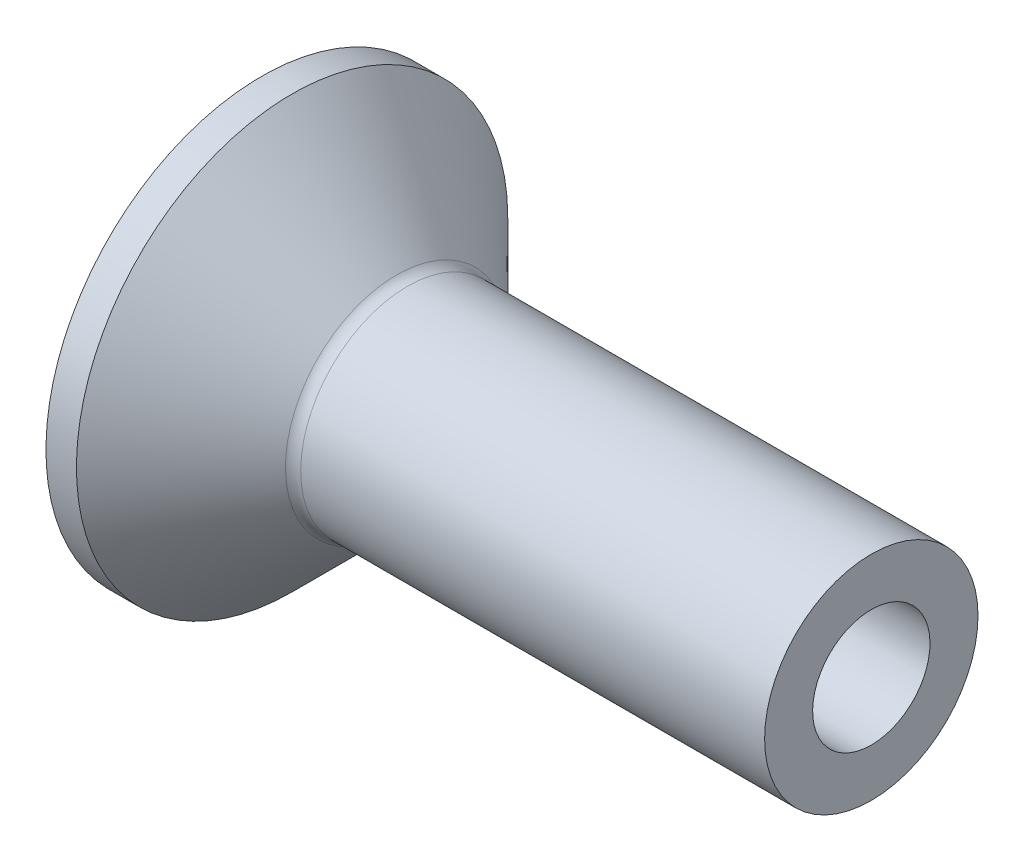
ISO-10303-21;
HEADER;
FILE_DESCRIPTION(('STEP AP214'),'2;1');
FILE_NAME('part.step','',(''),(''),'','','');
FILE_SCHEMA(('AUTOMOTIVE_DESIGN { 1 0 10303 214 1 1 1 1 }'));
ENDSEC;
DATA;
#1=APPLICATION_CONTEXT('core data for automotive mechanical design processes');
#2=APPLICATION_PROTOCOL_DEFINITION('international standard','automotive_design',2000,#1);
#3=PRODUCT_CONTEXT('',#1,'mechanical');
#4=PRODUCT('Part','Part','',(#3));
#5=PRODUCT_RELATED_PRODUCT_CATEGORY('part','',(#4));
#6=PRODUCT_DEFINITION_FORMATION('','',#4);
#7=PRODUCT_DEFINITION_CONTEXT('part definition',#1,'design');
#8=PRODUCT_DEFINITION('design','',#6,#7);
#9=PRODUCT_DEFINITION_SHAPE('','',#8);
#10=(LENGTH_UNIT() NAMED_UNIT(*) SI_UNIT(.MILLI.,.METRE.));
#11=(NAMED_UNIT(*) PLANE_ANGLE_UNIT() SI_UNIT($,.RADIAN.));
#12=(NAMED_UNIT(*) SI_UNIT($,.STERADIAN.) SOLID_ANGLE_UNIT());
#13=UNCERTAINTY_MEASURE_WITH_UNIT(LENGTH_MEASURE(1.E-05),#10,'distance_accuracy_value','');
#14=(GEOMETRIC_REPRESENTATION_CONTEXT(3) GLOBAL_UNCERTAINTY_ASSIGNED_CONTEXT((#13)) GLOBAL_UNIT_ASSIGNED_CONTEXT((#10,
#11,#12)) REPRESENTATION_CONTEXT('',''));
#15=CARTESIAN_POINT('',(0.,0.,0.));
#16=DIRECTION('',(0.,0.,1.));
#17=DIRECTION('',(1.,0.,0.));
#18=AXIS2_PLACEMENT_3D('',#15,#16,#17);
#19=CARTESIAN_POINT('',(4.,0.700000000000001,0.));
#20=DIRECTION('',(-1.,0.,0.));
#21=DIRECTION('',(0.,-1.,0.));
#22=AXIS2_PLACEMENT_3D('',#19,#20,#21);
#23=PLANE('',#22);
#24=CARTESIAN_POINT('',(4.,0.,0.));
#25=DIRECTION('',(-1.,0.,0.));
#26=DIRECTION('',(0.,-1.,0.));
#27=AXIS2_PLACEMENT_3D('',#24,#25,#26);
#28=CIRCLE('',#27,0.7);
#29=CARTESIAN_POINT('',(4.,-0.7,0.));
#30=VERTEX_POINT('',#29);
#31=EDGE_CURVE('E51',#30,#30,#28,.T.);
#32=ORIENTED_EDGE('',*,*,#31,.F.);
#33=EDGE_LOOP('',(#32));
#34=FACE_BOUND('',#33,.T.);
#35=CARTESIAN_POINT('',(4.,0.,0.));
#36=DIRECTION('',(-1.,0.,0.));
#37=DIRECTION('',(0.,-1.,0.));
#38=AXIS2_PLACEMENT_3D('',#35,#36,#37);
#39=CIRCLE('',#38,0.385);
#40=CARTESIAN_POINT('',(4.,-0.384999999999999,0.));
#41=VERTEX_POINT('',#40);
#42=EDGE_CURVE('E52',#41,#41,#39,.T.);
#43=ORIENTED_EDGE('',*,*,#42,.T.);
#44=EDGE_LOOP('',(#43));
#45=FACE_BOUND('',#44,.T.);
#46=ADVANCED_FACE('F32',(#34,#45),#23,.F.);
#47=CARTESIAN_POINT('',(0.,0.,0.));
#48=DIRECTION('',(1.,0.,0.));
#49=DIRECTION('',(0.,1.,0.));
#50=AXIS2_PLACEMENT_3D('',#47,#48,#49);
#51=PLANE('',#50);
#52=CARTESIAN_POINT('',(0.,0.,0.));
#53=DIRECTION('',(-1.,0.,0.));
#54=DIRECTION('',(0.,-1.,0.));
#55=AXIS2_PLACEMENT_3D('',#52,#53,#54);
#56=CIRCLE('',#55,1.415);
#57=CARTESIAN_POINT('',(0.,-1.415,0.));
#58=VERTEX_POINT('',#57);
#59=EDGE_CURVE('E62',#58,#58,#56,.T.);
#60=ORIENTED_EDGE('',*,*,#59,.T.);
#61=EDGE_LOOP('',(#60));
#62=FACE_BOUND('',#61,.T.);
#63=ADVANCED_FACE('F80',(#62),#51,.F.);
#64=CARTESIAN_POINT('',(-2.3225,0.,0.));
#65=DIRECTION('',(-1.,0.,0.));
#66=DIRECTION('',(0.,-1.,0.));
#67=AXIS2_PLACEMENT_3D('',#64,#65,#66);
#68=CYLINDRICAL_SURFACE('',#67,1.415);
#69=ORIENTED_EDGE('',*,*,#59,.F.);
#70=EDGE_LOOP('',(#69));
#71=FACE_BOUND('',#70,.T.);
#72=CARTESIAN_POINT('',(0.2,0.,0.));
#73=DIRECTION('',(-1.,0.,0.));
#74=DIRECTION('',(0.,-1.,0.));
#75=AXIS2_PLACEMENT_3D('',#72,#73,#74);
#76=CIRCLE('',#75,1.415);
#77=CARTESIAN_POINT('',(0.2,-1.415,0.));
#78=VERTEX_POINT('',#77);
#79=EDGE_CURVE('E55',#78,#78,#76,.T.);
#80=ORIENTED_EDGE('',*,*,#79,.T.);
#81=EDGE_LOOP('',(#80));
#82=FACE_BOUND('',#81,.T.);
#83=ADVANCED_FACE('F86',(#71,#82),#68,.T.);
#84=CARTESIAN_POINT('',(0.914999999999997,0.,0.));
#85=DIRECTION('',(-1.,0.,0.));
#86=DIRECTION('',(0.,-1.,0.));
#87=AXIS2_PLACEMENT_3D('',#84,#85,#86);
#88=CONICAL_SURFACE('',#87,0.7,0.78539816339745);
#89=CARTESIAN_POINT('',(0.885710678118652,0.,0.));
#90=DIRECTION('',(-1.,0.,0.));
#91=DIRECTION('',(0.,-1.,0.));
#92=AXIS2_PLACEMENT_3D('',#89,#90,#91);
#93=CIRCLE('',#92,0.729289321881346);
#94=CARTESIAN_POINT('',(0.885710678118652,-0.729289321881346,0.));
#95=VERTEX_POINT('',#94);
#96=EDGE_CURVE('E39',#95,#95,#93,.T.);
#97=ORIENTED_EDGE('',*,*,#96,.T.);
#98=EDGE_LOOP('',(#97));
#99=FACE_BOUND('',#98,.T.);
#100=ORIENTED_EDGE('',*,*,#79,.F.);
#101=EDGE_LOOP('',(#100));
#102=FACE_BOUND('',#101,.T.);
#103=ADVANCED_FACE('F67',(#99,#102),#88,.T.);
#104=CARTESIAN_POINT('',(-2.3225,0.,0.));
#105=DIRECTION('',(-1.,0.,0.));
#106=DIRECTION('',(0.,-1.,0.));
#107=AXIS2_PLACEMENT_3D('',#104,#105,#106);
#108=CYLINDRICAL_SURFACE('',#107,0.7);
#109=CARTESIAN_POINT('',(0.956421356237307,0.,0.));
#110=DIRECTION('',(-1.,0.,0.));
#111=DIRECTION('',(0.,-1.,0.));
#112=AXIS2_PLACEMENT_3D('',#109,#110,#111);
#113=CIRCLE('',#112,0.7);
#114=CARTESIAN_POINT('',(0.956421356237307,-0.7,0.));
#115=VERTEX_POINT('',#114);
#116=EDGE_CURVE('E11',#115,#115,#113,.F.);
#117=ORIENTED_EDGE('',*,*,#116,.T.);
#118=EDGE_LOOP('',(#117));
#119=FACE_BOUND('',#118,.T.);
#120=ORIENTED_EDGE('',*,*,#31,.T.);
#121=EDGE_LOOP('',(#120));
#122=FACE_BOUND('',#121,.T.);
#123=ADVANCED_FACE('F71',(#119,#122),#108,.T.);
#124=CARTESIAN_POINT('',(0.956421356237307,0.,0.));
#125=DIRECTION('',(-1.,0.,0.));
#126=DIRECTION('',(0.,-1.,0.));
#127=AXIS2_PLACEMENT_3D('',#124,#125,#126);
#128=TOROIDAL_SURFACE('',#127,0.8,0.1);
#129=ORIENTED_EDGE('',*,*,#116,.F.);
#130=EDGE_LOOP('',(#129));
#131=FACE_BOUND('',#130,.T.);
#132=ORIENTED_EDGE('',*,*,#96,.F.);
#133=EDGE_LOOP('',(#132));
#134=FACE_BOUND('',#133,.T.);
#135=ADVANCED_FACE('F34',(#131,#134),#128,.F.);
#136=CARTESIAN_POINT('',(2.84,0.,0.));
#137=DIRECTION('',(1.,0.,0.));
#138=DIRECTION('',(0.,1.,0.));
#139=AXIS2_PLACEMENT_3D('',#136,#137,#138);
#140=CONICAL_SURFACE('',#139,0.385,0.94247779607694);
#141=CARTESIAN_POINT('',(2.56028112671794,0.,0.));
#142=VERTEX_POINT('',#141);
#143=VERTEX_LOOP('',#142);
#144=FACE_BOUND('',#143,.T.);
#145=CARTESIAN_POINT('',(2.84,0.,0.));
#146=DIRECTION('',(-1.,0.,0.));
#147=DIRECTION('',(0.,-1.,0.));
#148=AXIS2_PLACEMENT_3D('',#145,#146,#147);
#149=CIRCLE('',#148,0.385);
#150=CARTESIAN_POINT('',(2.84,-0.384999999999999,0.));
#151=VERTEX_POINT('',#150);
#152=EDGE_CURVE('E49',#151,#151,#149,.T.);
#153=ORIENTED_EDGE('',*,*,#152,.F.);
#154=EDGE_LOOP('',(#153));
#155=FACE_BOUND('',#154,.T.);
#156=ADVANCED_FACE('F42',(#144,#155),#140,.F.);
#157=CARTESIAN_POINT('',(-1.1851609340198,0.,0.));
#158=DIRECTION('',(-1.,0.,0.));
#159=DIRECTION('',(0.,-1.,0.));
#160=AXIS2_PLACEMENT_3D('',#157,#158,#159);
#161=CYLINDRICAL_SURFACE('',#160,0.385);
#162=ORIENTED_EDGE('',*,*,#152,.T.);
#163=EDGE_LOOP('',(#162));
#164=FACE_BOUND('',#163,.T.);
#165=ORIENTED_EDGE('',*,*,#42,.F.);
#166=EDGE_LOOP('',(#165));
#167=FACE_BOUND('',#166,.T.);
#168=ADVANCED_FACE('F45',(#164,#167),#161,.F.);
#169=CLOSED_SHELL('',(#46,#63,#83,#103,#123,#135,#156,#168));
#170=MANIFOLD_SOLID_BREP('B2',#169);
#171=ADVANCED_BREP_SHAPE_REPRESENTATION('',(#18,#170),#14);
#172=SHAPE_DEFINITION_REPRESENTATION(#9,#171);
ENDSEC;
END-ISO-10303-21;
